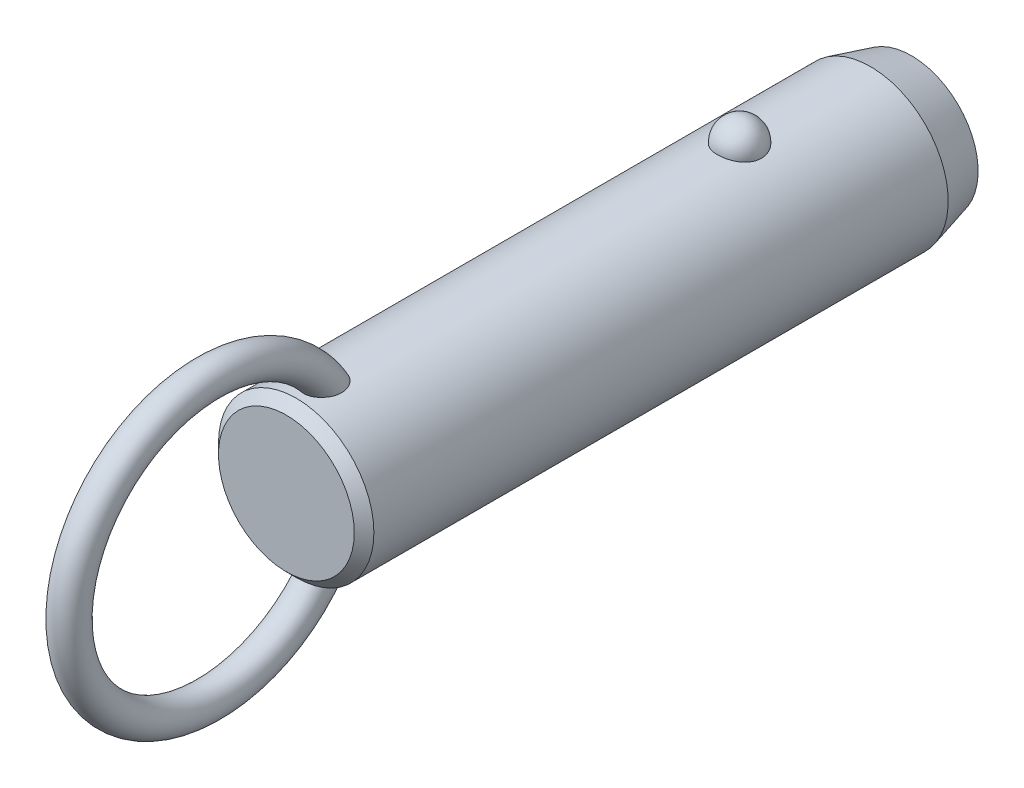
ISO-10303-21;
HEADER;
FILE_DESCRIPTION(('STEP AP214'),'2;1');
FILE_NAME('part.step','',(''),(''),'','','');
FILE_SCHEMA(('AUTOMOTIVE_DESIGN { 1 0 10303 214 1 1 1 1 }'));
ENDSEC;
DATA;
#1=APPLICATION_CONTEXT('core data for automotive mechanical design processes');
#2=APPLICATION_PROTOCOL_DEFINITION('international standard','automotive_design',2000,#1);
#3=PRODUCT_CONTEXT('',#1,'mechanical');
#4=PRODUCT('Part','Part','',(#3));
#5=PRODUCT_RELATED_PRODUCT_CATEGORY('part','',(#4));
#6=PRODUCT_DEFINITION_FORMATION('','',#4);
#7=PRODUCT_DEFINITION_CONTEXT('part definition',#1,'design');
#8=PRODUCT_DEFINITION('design','',#6,#7);
#9=PRODUCT_DEFINITION_SHAPE('','',#8);
#10=(LENGTH_UNIT() NAMED_UNIT(*) SI_UNIT(.MILLI.,.METRE.));
#11=(NAMED_UNIT(*) PLANE_ANGLE_UNIT() SI_UNIT($,.RADIAN.));
#12=(NAMED_UNIT(*) SI_UNIT($,.STERADIAN.) SOLID_ANGLE_UNIT());
#13=UNCERTAINTY_MEASURE_WITH_UNIT(LENGTH_MEASURE(1.E-05),#10,'distance_accuracy_value','');
#14=(GEOMETRIC_REPRESENTATION_CONTEXT(3) GLOBAL_UNCERTAINTY_ASSIGNED_CONTEXT((#13)) GLOBAL_UNIT_ASSIGNED_CONTEXT((#10,
#11,#12)) REPRESENTATION_CONTEXT('',''));
#15=CARTESIAN_POINT('',(0.,0.,0.));
#16=DIRECTION('',(0.,0.,1.));
#17=DIRECTION('',(1.,0.,0.));
#18=AXIS2_PLACEMENT_3D('',#15,#16,#17);
#19=CARTESIAN_POINT('',(0.,0.,43.2));
#20=DIRECTION('',(0.,0.,-1.));
#21=DIRECTION('',(-1.,0.,0.));
#22=AXIS2_PLACEMENT_3D('',#19,#20,#21);
#23=CYLINDRICAL_SURFACE('',#22,9.5);
#24=CARTESIAN_POINT('',(2.67259918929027,9.11631578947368,-2.7));
#25=CARTESIAN_POINT('',(2.6725968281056,9.11631786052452,-2.54909854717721));
#26=CARTESIAN_POINT('',(2.66030567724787,9.11994722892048,-2.39816735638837));
#27=CARTESIAN_POINT('',(2.6114347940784,9.13405924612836,-2.10058568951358));
#28=CARTESIAN_POINT('',(2.57484658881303,9.14454428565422,-1.95393672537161));
#29=CARTESIAN_POINT('',(2.47830875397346,9.17117631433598,-1.66916069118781));
#30=CARTESIAN_POINT('',(2.41836936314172,9.18732082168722,-1.53102991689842));
#31=CARTESIAN_POINT('',(2.27661331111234,9.22346780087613,-1.26705393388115));
#32=CARTESIAN_POINT('',(2.19479699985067,9.24347021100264,-1.14120852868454));
#33=CARTESIAN_POINT('',(2.01085282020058,9.28522401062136,-0.904632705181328));
#34=CARTESIAN_POINT('',(1.90862396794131,9.30698376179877,-0.793982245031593));
#35=CARTESIAN_POINT('',(1.6867437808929,9.34973971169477,-0.591607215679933));
#36=CARTESIAN_POINT('',(1.56709244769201,9.37073591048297,-0.49988264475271));
#37=CARTESIAN_POINT('',(1.31393976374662,9.40956370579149,-0.338167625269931));
#38=CARTESIAN_POINT('',(1.18048026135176,9.42740444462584,-0.268113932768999));
#39=CARTESIAN_POINT('',(0.903154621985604,9.45799906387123,-0.151390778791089));
#40=CARTESIAN_POINT('',(0.759289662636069,9.47075351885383,-0.104718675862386));
#41=CARTESIAN_POINT('',(0.468074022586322,9.48956256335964,-0.0367633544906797));
#42=CARTESIAN_POINT('',(0.320836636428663,9.49573643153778,-0.015027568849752));
#43=CARTESIAN_POINT('',(0.0246714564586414,9.50112183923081,0.00396199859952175));
#44=CARTESIAN_POINT('',(-0.124256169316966,9.50033406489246,0.00121819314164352));
#45=CARTESIAN_POINT('',(-0.417264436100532,9.4919475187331,-0.0284441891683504));
#46=CARTESIAN_POINT('',(-0.56138413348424,9.48444885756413,-0.0550074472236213));
#47=CARTESIAN_POINT('',(-0.842986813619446,9.46357853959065,-0.131064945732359));
#48=CARTESIAN_POINT('',(-0.980469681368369,9.450206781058,-0.180559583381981));
#49=CARTESIAN_POINT('',(-1.24585005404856,9.41890822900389,-0.301476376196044));
#50=CARTESIAN_POINT('',(-1.37368611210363,9.40095498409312,-0.373026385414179));
#51=CARTESIAN_POINT('',(-1.61552738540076,9.3624296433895,-0.536025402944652));
#52=CARTESIAN_POINT('',(-1.72953116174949,9.34185727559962,-0.627476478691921));
#53=CARTESIAN_POINT('',(-1.9429225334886,9.29984568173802,-0.829844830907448));
#54=CARTESIAN_POINT('',(-2.04198021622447,9.27839736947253,-0.941108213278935));
#55=CARTESIAN_POINT('',(-2.2202646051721,9.23735994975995,-1.17883414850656));
#56=CARTESIAN_POINT('',(-2.29948985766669,9.21777097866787,-1.30529781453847));
#57=CARTESIAN_POINT('',(-2.43697287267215,9.18238994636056,-1.57158566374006));
#58=CARTESIAN_POINT('',(-2.49497068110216,9.16664569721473,-1.71155057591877));
#59=CARTESIAN_POINT('',(-2.5872073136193,9.14104303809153,-1.99961197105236));
#60=CARTESIAN_POINT('',(-2.62144683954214,9.13118445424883,-2.14770821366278));
#61=CARTESIAN_POINT('',(-2.66521466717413,9.11850622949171,-2.44715424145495));
#62=CARTESIAN_POINT('',(-2.67484831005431,9.11565658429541,-2.59848735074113));
#63=CARTESIAN_POINT('',(-2.66946735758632,9.11723375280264,-2.90067317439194));
#64=CARTESIAN_POINT('',(-2.65445345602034,9.12166036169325,-3.05152590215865));
#65=CARTESIAN_POINT('',(-2.60029711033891,9.13724422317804,-3.34766110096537));
#66=CARTESIAN_POINT('',(-2.56127978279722,9.14836656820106,-3.49296833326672));
#67=CARTESIAN_POINT('',(-2.46018844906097,9.17606676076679,-3.77477535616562));
#68=CARTESIAN_POINT('',(-2.39811349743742,9.1926448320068,-3.9112747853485));
#69=CARTESIAN_POINT('',(-2.25202303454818,9.22952198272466,-4.17244273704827));
#70=CARTESIAN_POINT('',(-2.16788714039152,9.24984129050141,-4.29704106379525));
#71=CARTESIAN_POINT('',(-1.9799408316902,9.29188255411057,-4.53013066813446));
#72=CARTESIAN_POINT('',(-1.87612963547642,9.31360456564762,-4.63862130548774));
#73=CARTESIAN_POINT('',(-1.65105429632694,9.35612959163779,-4.8369029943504));
#74=CARTESIAN_POINT('',(-1.52972405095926,9.37692871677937,-4.92661991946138));
#75=CARTESIAN_POINT('',(-1.27318250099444,9.41518970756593,-5.08429106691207));
#76=CARTESIAN_POINT('',(-1.13797219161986,9.432651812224,-5.15224684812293));
#77=CARTESIAN_POINT('',(-0.859280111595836,9.46208255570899,-5.26371827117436));
#78=CARTESIAN_POINT('',(-0.715925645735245,9.47411833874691,-5.30753421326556));
#79=CARTESIAN_POINT('',(-0.423550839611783,9.4916822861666,-5.37076321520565));
#80=CARTESIAN_POINT('',(-0.274531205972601,9.49721125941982,-5.39017930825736));
#81=CARTESIAN_POINT('',(0.0218446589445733,9.50110860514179,-5.40390587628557));
#82=CARTESIAN_POINT('',(0.169177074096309,9.49961381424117,-5.39869609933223));
#83=CARTESIAN_POINT('',(0.460808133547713,9.48993906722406,-5.36441955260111));
#84=CARTESIAN_POINT('',(0.605106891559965,9.48175936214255,-5.33535367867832));
#85=CARTESIAN_POINT('',(0.886027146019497,9.4596376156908,-5.25435587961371));
#86=CARTESIAN_POINT('',(1.02267710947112,9.44571881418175,-5.20251612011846));
#87=CARTESIAN_POINT('',(1.28523827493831,9.41358993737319,-5.07741549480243));
#88=CARTESIAN_POINT('',(1.41114877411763,9.39537958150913,-5.00415322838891));
#89=CARTESIAN_POINT('',(1.65085227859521,9.3562644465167,-4.83684599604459));
#90=CARTESIAN_POINT('',(1.76442346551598,9.33532178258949,-4.74249218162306));
#91=CARTESIAN_POINT('',(1.97425672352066,9.29321198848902,-4.53620389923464));
#92=CARTESIAN_POINT('',(2.07051582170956,9.27204482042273,-4.42426641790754));
#93=CARTESIAN_POINT('',(2.24490086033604,9.23139221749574,-4.18363183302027));
#94=CARTESIAN_POINT('',(2.32267019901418,9.21194380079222,-4.05466990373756));
#95=CARTESIAN_POINT('',(2.45584092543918,9.1773419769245,-3.78517836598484));
#96=CARTESIAN_POINT('',(2.5112497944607,9.16218713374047,-3.64465264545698));
#97=CARTESIAN_POINT('',(2.59380876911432,9.13913522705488,-3.37104301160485));
#98=CARTESIAN_POINT('',(2.62330266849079,9.13064624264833,-3.23871053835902));
#99=CARTESIAN_POINT('',(2.66269870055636,9.11923566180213,-2.97092664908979));
#100=CARTESIAN_POINT('',(2.67260130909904,9.11631393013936,-2.83547530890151));
#101=CARTESIAN_POINT('',(2.67259918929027,9.11631578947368,-2.7));
#102=B_SPLINE_CURVE_WITH_KNOTS('',3,(#24,#25,#26,#27,#28,#29,#30,#31,#32,#33,#34,#35,#36,#37,
#38,#39,#40,#41,#42,#43,#44,#45,#46,#47,#48,#49,#50,#51,#52,#53,#54,#55,#56,#57,#58,#59,#60,#61,
#62,#63,#64,#65,#66,#67,#68,#69,#70,#71,#72,#73,#74,#75,#76,#77,#78,#79,#80,#81,#82,#83,#84,#85,
#86,#87,#88,#89,#90,#91,#92,#93,#94,#95,#96,#97,#98,#99,#100,#101),.UNSPECIFIED.,.T.,.F.,(4,2,2,
2,2,2,2,2,2,2,2,2,2,2,2,2,2,2,2,2,2,2,2,2,2,2,2,2,2,2,2,2,2,2,2,2,2,2,4),(0.,0.452217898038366,
0.904593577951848,1.35677112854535,1.80894144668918,2.26340676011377,2.71787203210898,
3.17099820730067,3.62407318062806,4.0687883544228,4.51345969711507,4.95160616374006,
5.38976021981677,5.83050358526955,6.27129275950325,6.72071308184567,7.17016633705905,
7.62495278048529,8.07972578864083,8.53254856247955,8.98535859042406,9.43582813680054,
9.88631615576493,10.3393155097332,10.7923328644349,11.2471065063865,11.7018475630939,
12.150795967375,12.599688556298,13.0398725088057,13.4800399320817,13.9184421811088,
14.3568730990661,14.802202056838,15.2476074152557,15.7010097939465,16.1542603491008,
16.5602594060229,16.966248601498),.UNSPECIFIED.);
#103=CARTESIAN_POINT('',(2.67259918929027,9.11631578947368,-2.7));
#104=VERTEX_POINT('',#103);
#105=EDGE_CURVE('E41',#104,#104,#102,.T.);
#106=ORIENTED_EDGE('',*,*,#105,.T.);
#107=EDGE_LOOP('',(#106));
#108=FACE_BOUND('',#107,.T.);
#109=CARTESIAN_POINT('',(0.,0.,51.5200000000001));
#110=DIRECTION('',(0.,0.,1.));
#111=DIRECTION('',(1.,0.,0.));
#112=AXIS2_PLACEMENT_3D('',#109,#110,#111);
#113=CIRCLE('',#112,9.5);
#114=CARTESIAN_POINT('',(9.5,0.,51.5200000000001));
#115=VERTEX_POINT('',#114);
#116=EDGE_CURVE('E10',#115,#115,#113,.F.);
#117=ORIENTED_EDGE('',*,*,#116,.T.);
#118=EDGE_LOOP('',(#117));
#119=FACE_BOUND('',#118,.T.);
#120=CARTESIAN_POINT('',(-0.697062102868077,-9.47439269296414,45.8678088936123));
#121=CARTESIAN_POINT('',(-0.799579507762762,-9.46685146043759,45.9074823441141));
#122=CARTESIAN_POINT('',(-0.898575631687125,-9.45788043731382,45.9559309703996));
#123=CARTESIAN_POINT('',(-1.08670047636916,-9.43811593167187,46.0688685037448));
#124=CARTESIAN_POINT('',(-1.17583204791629,-9.42732297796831,46.133352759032));
#125=CARTESIAN_POINT('',(-1.34179806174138,-9.40513672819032,46.2762099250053));
#126=CARTESIAN_POINT('',(-1.41865133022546,-9.39374438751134,46.354561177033));
#127=CARTESIAN_POINT('',(-1.5586004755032,-9.37154196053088,46.5227524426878));
#128=CARTESIAN_POINT('',(-1.62169476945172,-9.3607319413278,46.6125937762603));
#129=CARTESIAN_POINT('',(-1.73527695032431,-9.34035749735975,46.8045001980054));
#130=CARTESIAN_POINT('',(-1.7852226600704,-9.33085270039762,46.9068910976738));
#131=CARTESIAN_POINT('',(-1.86924997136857,-9.3143834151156,47.118148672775));
#132=CARTESIAN_POINT('',(-1.90332570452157,-9.30741986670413,47.2270177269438));
#133=CARTESIAN_POINT('',(-1.95893603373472,-9.29588482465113,47.4604730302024));
#134=CARTESIAN_POINT('',(-1.97872420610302,-9.29165182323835,47.5854890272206));
#135=CARTESIAN_POINT('',(-2.00062129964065,-9.28695978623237,47.8370805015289));
#136=CARTESIAN_POINT('',(-2.00272284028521,-9.28650232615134,47.963656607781));
#137=CARTESIAN_POINT('',(-1.98958876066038,-9.28932750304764,48.2368157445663));
#138=CARTESIAN_POINT('',(-1.97143366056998,-9.2932400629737,48.3832519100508));
#139=CARTESIAN_POINT('',(-1.91479925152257,-9.30507151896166,48.6720629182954));
#140=CARTESIAN_POINT('',(-1.87629122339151,-9.31299607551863,48.814431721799));
#141=CARTESIAN_POINT('',(-1.77225683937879,-9.33340232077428,49.1151725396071));
#142=CARTESIAN_POINT('',(-1.70334898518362,-9.34641636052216,49.2723691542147));
#143=CARTESIAN_POINT('',(-1.58111062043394,-9.36759153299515,49.4975171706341));
#144=CARTESIAN_POINT('',(-1.53721459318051,-9.37492619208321,49.5707968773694));
#145=CARTESIAN_POINT('',(-1.44302631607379,-9.38988566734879,49.7130740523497));
#146=CARTESIAN_POINT('',(-1.39273721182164,-9.39751033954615,49.7820736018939));
#147=CARTESIAN_POINT('',(-1.26775962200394,-9.41530678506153,49.9369832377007));
#148=CARTESIAN_POINT('',(-1.19052326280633,-9.42548108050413,50.0208712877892));
#149=CARTESIAN_POINT('',(-1.0242024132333,-9.44499825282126,50.1760086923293));
#150=CARTESIAN_POINT('',(-0.935139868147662,-9.45434261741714,50.2472808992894));
#151=CARTESIAN_POINT('',(-0.766610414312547,-9.46930670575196,50.3586955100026));
#152=CARTESIAN_POINT('',(-0.689439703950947,-9.47529223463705,50.4022354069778));
#153=CARTESIAN_POINT('',(-0.528942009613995,-9.48560294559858,50.4763133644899));
#154=CARTESIAN_POINT('',(-0.445620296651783,-9.48992953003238,50.5068624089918));
#155=CARTESIAN_POINT('',(-0.273901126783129,-9.49644161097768,50.5525792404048));
#156=CARTESIAN_POINT('',(-0.185465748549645,-9.49860811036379,50.56761059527));
#157=CARTESIAN_POINT('',(-0.00734541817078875,-9.5004135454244,50.5801494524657));
#158=CARTESIAN_POINT('',(0.0823387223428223,-9.50005405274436,50.5776678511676));
#159=CARTESIAN_POINT('',(0.247679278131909,-9.49708301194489,50.5569959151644));
#160=CARTESIAN_POINT('',(0.323620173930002,-9.49477609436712,50.5409300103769));
#161=CARTESIAN_POINT('',(0.471981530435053,-9.48855917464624,50.4971726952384));
#162=CARTESIAN_POINT('',(0.544400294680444,-9.48464840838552,50.4694757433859));
#163=CARTESIAN_POINT('',(0.708947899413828,-9.47398336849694,50.3928026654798));
#164=CARTESIAN_POINT('',(0.799149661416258,-9.46671310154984,50.3397745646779));
#165=CARTESIAN_POINT('',(0.969783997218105,-9.4507622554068,50.2199731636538));
#166=CARTESIAN_POINT('',(1.05019415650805,-9.44207854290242,50.1531692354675));
#167=CARTESIAN_POINT('',(1.23092343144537,-9.42051459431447,49.9807596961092));
#168=CARTESIAN_POINT('',(1.32652499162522,-9.40733378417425,49.8702619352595));
#169=CARTESIAN_POINT('',(1.49893121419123,-9.38140745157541,49.6355614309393));
#170=CARTESIAN_POINT('',(1.57571616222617,-9.36866239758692,49.5113445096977));
#171=CARTESIAN_POINT('',(1.71285426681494,-9.34457644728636,49.2493891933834));
#172=CARTESIAN_POINT('',(1.77266365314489,-9.33328726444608,49.1113623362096));
#173=CARTESIAN_POINT('',(1.87239208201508,-9.31379209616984,48.8280515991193));
#174=CARTESIAN_POINT('',(1.91230158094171,-9.3055875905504,48.682764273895));
#175=CARTESIAN_POINT('',(1.9760418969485,-9.29228394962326,48.3620281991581));
#176=CARTESIAN_POINT('',(1.99587438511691,-9.28797202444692,48.1857248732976));
#177=CARTESIAN_POINT('',(2.0029570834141,-9.28645519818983,47.8324146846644));
#178=CARTESIAN_POINT('',(1.99025930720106,-9.28923895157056,47.6554093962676));
#179=CARTESIAN_POINT('',(1.93735479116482,-9.30038134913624,47.3563381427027));
#180=CARTESIAN_POINT('',(1.90576827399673,-9.30697680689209,47.2326679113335));
#181=CARTESIAN_POINT('',(1.82287484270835,-9.32356855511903,46.9923297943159));
#182=CARTESIAN_POINT('',(1.77158213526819,-9.33356239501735,46.8756569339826));
#183=CARTESIAN_POINT('',(1.64885744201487,-9.35602275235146,46.6527061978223));
#184=CARTESIAN_POINT('',(1.57730995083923,-9.36850332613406,46.5464927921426));
#185=CARTESIAN_POINT('',(1.41543264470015,-9.39431873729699,46.3495530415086));
#186=CARTESIAN_POINT('',(1.32510883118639,-9.40765330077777,46.2588217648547));
#187=CARTESIAN_POINT('',(1.13846223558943,-9.43195720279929,46.1050334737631));
#188=CARTESIAN_POINT('',(1.04369890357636,-9.44302894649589,46.0400947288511));
#189=CARTESIAN_POINT('',(0.843965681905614,-9.46296805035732,45.9280388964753));
#190=CARTESIAN_POINT('',(0.739000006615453,-9.4718363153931,45.8809144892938));
#191=CARTESIAN_POINT('',(0.528175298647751,-9.48586140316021,45.8081173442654));
#192=CARTESIAN_POINT('',(0.422686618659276,-9.49119633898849,45.7814024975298));
#193=CARTESIAN_POINT('',(0.208590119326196,-9.49831365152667,45.7460137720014));
#194=CARTESIAN_POINT('',(0.0999817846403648,-9.500095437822,45.7373428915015));
#195=CARTESIAN_POINT('',(-0.12610480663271,-9.49988861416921,45.7383501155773));
#196=CARTESIAN_POINT('',(-0.243578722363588,-9.49757821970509,45.7495942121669));
#197=CARTESIAN_POINT('',(-0.474390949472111,-9.48885165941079,45.793167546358));
#198=CARTESIAN_POINT('',(-0.587729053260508,-9.48243528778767,45.8254978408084));
#199=CARTESIAN_POINT('',(-0.697062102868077,-9.47439269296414,45.8678088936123));
#200=B_SPLINE_CURVE_WITH_KNOTS('',3,(#120,#121,#122,#123,#124,#125,#126,#127,#128,#129,#130,
#131,#132,#133,#134,#135,#136,#137,#138,#139,#140,#141,#142,#143,#144,#145,#146,#147,#148,#149,
#150,#151,#152,#153,#154,#155,#156,#157,#158,#159,#160,#161,#162,#163,#164,#165,#166,#167,#168,
#169,#170,#171,#172,#173,#174,#175,#176,#177,#178,#179,#180,#181,#182,#183,#184,#185,#186,#187,
#188,#189,#190,#191,#192,#193,#194,#195,#196,#197,#198,#199),.UNSPECIFIED.,.T.,.F.,(4,2,2,2,2,2,
2,2,2,2,2,2,2,2,2,2,2,2,2,2,2,2,2,2,2,2,2,2,2,2,2,2,2,2,2,2,2,2,2,4),(0.,0.330119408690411,
0.660143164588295,0.989655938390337,1.31920659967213,1.66074728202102,2.00241415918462,
2.38088696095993,2.75951768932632,3.20065679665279,3.6424200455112,4.15620996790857,
4.41314162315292,4.66994734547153,5.01228664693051,5.35399933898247,5.61943037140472,
5.88463652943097,6.15215502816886,6.41950709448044,6.65144391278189,6.88349136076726,
7.19641200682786,7.51003602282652,7.94779711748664,8.38601491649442,8.83699707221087,
9.28819530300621,9.81778662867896,10.3465317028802,10.7284172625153,11.1100280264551,
11.4938603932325,11.8775702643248,12.2220189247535,12.5663259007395,12.8915939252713,
13.2169159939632,13.5689650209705,13.9210316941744),.UNSPECIFIED.);
#201=CARTESIAN_POINT('',(-0.697062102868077,-9.47439269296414,45.8678088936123));
#202=VERTEX_POINT('',#201);
#203=EDGE_CURVE('E60',#202,#202,#200,.T.);
#204=ORIENTED_EDGE('',*,*,#203,.T.);
#205=EDGE_LOOP('',(#204));
#206=FACE_BOUND('',#205,.T.);
#207=CARTESIAN_POINT('',(-0.697062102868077,9.47439269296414,45.8678088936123));
#208=CARTESIAN_POINT('',(-0.597792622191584,9.48169483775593,45.8293956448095));
#209=CARTESIAN_POINT('',(-0.495106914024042,9.48766580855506,45.7991682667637));
#210=CARTESIAN_POINT('',(-0.285876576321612,9.49627648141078,45.7560327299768));
#211=CARTESIAN_POINT('',(-0.179324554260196,9.49890941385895,45.7431597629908));
#212=CARTESIAN_POINT('',(0.0344157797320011,9.50053798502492,45.7351666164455));
#213=CARTESIAN_POINT('',(0.141603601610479,9.49953613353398,45.7400341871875));
#214=CARTESIAN_POINT('',(0.353563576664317,9.49401038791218,45.7673654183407));
#215=CARTESIAN_POINT('',(0.458336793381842,9.48948807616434,45.78982117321));
#216=CARTESIAN_POINT('',(0.662493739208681,9.4774236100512,45.8516719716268));
#217=CARTESIAN_POINT('',(0.761881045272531,9.46988348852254,45.8910556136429));
#218=CARTESIAN_POINT('',(0.952608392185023,9.45260382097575,45.9856342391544));
#219=CARTESIAN_POINT('',(1.04394806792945,9.44286417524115,46.0408299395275));
#220=CARTESIAN_POINT('',(1.21712767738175,9.4221176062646,46.1660662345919));
#221=CARTESIAN_POINT('',(1.29885671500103,9.41109835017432,46.2362579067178));
#222=CARTESIAN_POINT('',(1.4497897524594,9.38903310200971,46.388980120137));
#223=CARTESIAN_POINT('',(1.51899278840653,9.37798710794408,46.4715116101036));
#224=CARTESIAN_POINT('',(1.64602857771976,9.35654375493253,46.6497763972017));
#225=CARTESIAN_POINT('',(1.70333052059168,9.34618688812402,46.7458916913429));
#226=CARTESIAN_POINT('',(1.80259341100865,9.32755128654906,46.945897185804));
#227=CARTESIAN_POINT('',(1.84454942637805,9.31927322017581,47.0497898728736));
#228=CARTESIAN_POINT('',(1.91637039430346,9.30478365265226,47.2722131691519));
#229=CARTESIAN_POINT('',(1.944805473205,9.29882552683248,47.3912192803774));
#230=CARTESIAN_POINT('',(1.98449865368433,9.29043398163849,47.6321436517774));
#231=CARTESIAN_POINT('',(1.99574908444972,9.28800213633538,47.7540631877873));
#232=CARTESIAN_POINT('',(2.00275141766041,9.28649645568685,48.0169324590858));
#233=CARTESIAN_POINT('',(1.99588238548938,9.28799035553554,48.1579529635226));
#234=CARTESIAN_POINT('',(1.96270559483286,9.29505517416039,48.4376217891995));
#235=CARTESIAN_POINT('',(1.93637872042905,9.30063010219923,48.576267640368));
#236=CARTESIAN_POINT('',(1.85949176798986,9.31633564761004,48.8725616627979));
#237=CARTESIAN_POINT('',(1.80549792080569,9.3270926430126,49.0292907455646));
#238=CARTESIAN_POINT('',(1.67376869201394,9.3516306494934,49.3322840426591));
#239=CARTESIAN_POINT('',(1.59603181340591,9.36541185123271,49.4785475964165));
#240=CARTESIAN_POINT('',(1.4360277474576,9.39110706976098,49.7258138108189));
#241=CARTESIAN_POINT('',(1.35831795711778,9.40278656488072,49.829791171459));
#242=CARTESIAN_POINT('',(1.18774483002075,9.42585025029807,50.0245347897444));
#243=CARTESIAN_POINT('',(1.09490932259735,9.43723493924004,50.1153247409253));
#244=CARTESIAN_POINT('',(0.921110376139,9.45552616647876,50.2562033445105));
#245=CARTESIAN_POINT('',(0.843738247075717,9.46281058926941,50.3106563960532));
#246=CARTESIAN_POINT('',(0.681245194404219,9.47589120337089,50.406711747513));
#247=CARTESIAN_POINT('',(0.596135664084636,9.48168953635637,50.4483325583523));
#248=CARTESIAN_POINT('',(0.433779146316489,9.49038144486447,50.5100899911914));
#249=CARTESIAN_POINT('',(0.357459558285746,9.49359170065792,50.5326013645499));
#250=CARTESIAN_POINT('',(0.202074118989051,9.49816761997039,50.5645745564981));
#251=CARTESIAN_POINT('',(0.123010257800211,9.49953459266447,50.5740456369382));
#252=CARTESIAN_POINT('',(-0.0357372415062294,9.50026497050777,50.5791143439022));
#253=CARTESIAN_POINT('',(-0.115421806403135,9.49962433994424,50.5746840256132));
#254=CARTESIAN_POINT('',(-0.272823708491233,9.49640854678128,50.5522962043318));
#255=CARTESIAN_POINT('',(-0.35054013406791,9.4938325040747,50.5343325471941));
#256=CARTESIAN_POINT('',(-0.500580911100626,9.4870946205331,50.4868028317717));
#257=CARTESIAN_POINT('',(-0.572979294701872,9.48296359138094,50.4574618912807));
#258=CARTESIAN_POINT('',(-0.712864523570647,9.47347609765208,50.3890087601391));
#259=CARTESIAN_POINT('',(-0.780349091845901,9.46811906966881,50.3498920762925));
#260=CARTESIAN_POINT('',(-0.946309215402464,9.45329720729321,50.239432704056));
#261=CARTESIAN_POINT('',(-1.04090230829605,9.44321512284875,50.1623297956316));
#262=CARTESIAN_POINT('',(-1.21661929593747,9.42219227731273,49.9940971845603));
#263=CARTESIAN_POINT('',(-1.29770519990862,9.41124921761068,49.9029292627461));
#264=CARTESIAN_POINT('',(-1.4731964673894,9.38563439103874,49.6761621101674));
#265=CARTESIAN_POINT('',(-1.56208878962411,9.37102009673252,49.5362895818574));
#266=CARTESIAN_POINT('',(-1.71623987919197,9.34401559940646,49.2439503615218));
#267=CARTESIAN_POINT('',(-1.7814786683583,9.33162728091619,49.0914731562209));
#268=CARTESIAN_POINT('',(-1.88853837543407,9.31055541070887,48.7756470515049));
#269=CARTESIAN_POINT('',(-1.9299899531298,9.30193076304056,48.6121685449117));
#270=CARTESIAN_POINT('',(-1.98590726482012,9.29015757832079,48.2805268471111));
#271=CARTESIAN_POINT('',(-2.00040705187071,9.2870021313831,48.1123698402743));
#272=CARTESIAN_POINT('',(-1.99964701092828,9.28716218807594,47.8050806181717));
#273=CARTESIAN_POINT('',(-1.98908145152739,9.28945704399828,47.6659362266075));
#274=CARTESIAN_POINT('',(-1.94566294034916,9.29865169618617,47.3911539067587));
#275=CARTESIAN_POINT('',(-1.91282062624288,9.30554929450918,47.255514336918));
#276=CARTESIAN_POINT('',(-1.84582133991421,9.31898248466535,47.0578026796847));
#277=CARTESIAN_POINT('',(-1.82038084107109,9.32400364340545,46.9925830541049));
#278=CARTESIAN_POINT('',(-1.76350511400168,9.33492884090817,46.8649033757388));
#279=CARTESIAN_POINT('',(-1.73207305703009,9.3408324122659,46.8024418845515));
#280=CARTESIAN_POINT('',(-1.66324243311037,9.353333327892,46.6809407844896));
#281=CARTESIAN_POINT('',(-1.62584239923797,9.35993084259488,46.6219020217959));
#282=CARTESIAN_POINT('',(-1.545276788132,9.37356864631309,46.5079875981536));
#283=CARTESIAN_POINT('',(-1.50211241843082,9.38060884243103,46.4531110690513));
#284=CARTESIAN_POINT('',(-1.37681147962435,9.40004442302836,46.3099619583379));
#285=CARTESIAN_POINT('',(-1.28916358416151,9.41261047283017,46.2264295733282));
#286=CARTESIAN_POINT('',(-1.09996826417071,9.43658180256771,46.0772360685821));
#287=CARTESIAN_POINT('',(-0.998461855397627,9.44799034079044,46.0115238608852));
#288=CARTESIAN_POINT('',(-0.860188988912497,9.46103017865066,45.9394367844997));
#289=CARTESIAN_POINT('',(-0.828141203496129,9.46389141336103,45.9238511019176));
#290=CARTESIAN_POINT('',(-0.763210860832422,9.46934915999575,45.8944734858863));
#291=CARTESIAN_POINT('',(-0.730328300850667,9.47194567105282,45.8806815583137));
#292=CARTESIAN_POINT('',(-0.697062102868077,9.47439269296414,45.8678088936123));
#293=B_SPLINE_CURVE_WITH_KNOTS('',3,(#207,#208,#209,#210,#211,#212,#213,#214,#215,#216,#217,
#218,#219,#220,#221,#222,#223,#224,#225,#226,#227,#228,#229,#230,#231,#232,#233,#234,#235,#236,
#237,#238,#239,#240,#241,#242,#243,#244,#245,#246,#247,#248,#249,#250,#251,#252,#253,#254,#255,
#256,#257,#258,#259,#260,#261,#262,#263,#264,#265,#266,#267,#268,#269,#270,#271,#272,#273,#274,
#275,#276,#277,#278,#279,#280,#281,#282,#283,#284,#285,#286,#287,#288,#289,#290,#291,#292),
.UNSPECIFIED.,.T.,.F.,(4,2,2,2,2,2,2,2,2,2,2,2,2,2,2,2,2,2,2,2,2,2,2,2,2,2,2,2,2,2,2,2,2,2,2,2,
2,2,2,2,2,2,4),(0.,0.319942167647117,0.640532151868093,0.96090081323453,1.28112555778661,
1.60113495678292,1.92115886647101,2.24457323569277,2.56801248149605,2.90371927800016,
3.23953387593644,3.60560313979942,3.97183576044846,4.39383693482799,4.81625324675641,
5.31257045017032,5.80891895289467,6.19868344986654,6.58773876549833,6.87145417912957,
7.15475838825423,7.3926375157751,7.63034760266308,7.86853584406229,8.10683246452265,
8.3406366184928,8.57454843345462,8.93983939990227,9.30614105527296,9.80266668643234,
10.2996107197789,10.8040753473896,11.3079021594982,11.7249776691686,12.1418541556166,
12.3521485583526,12.562331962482,12.7725671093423,12.9827582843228,13.3458276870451,
13.7078449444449,13.8150604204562,13.9222762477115),.UNSPECIFIED.);
#294=CARTESIAN_POINT('',(-0.697062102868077,9.47439269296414,45.8678088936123));
#295=VERTEX_POINT('',#294);
#296=EDGE_CURVE('E67',#295,#295,#293,.T.);
#297=ORIENTED_EDGE('',*,*,#296,.T.);
#298=EDGE_LOOP('',(#297));
#299=FACE_BOUND('',#298,.T.);
#300=CARTESIAN_POINT('',(0.,0.,-18.7));
#301=DIRECTION('',(0.,0.,-1.));
#302=DIRECTION('',(-1.,0.,0.));
#303=AXIS2_PLACEMENT_3D('',#300,#301,#302);
#304=CIRCLE('',#303,9.5);
#305=CARTESIAN_POINT('',(-9.5,0.,-18.7));
#306=VERTEX_POINT('',#305);
#307=EDGE_CURVE('E57',#306,#306,#304,.F.);
#308=ORIENTED_EDGE('',*,*,#307,.T.);
#309=EDGE_LOOP('',(#308));
#310=FACE_BOUND('',#309,.T.);
#311=ADVANCED_FACE('F37',(#108,#119,#206,#299,#310),#23,.T.);
#312=CARTESIAN_POINT('',(0.,0.,-23.7));
#313=DIRECTION('',(0.,0.,-1.));
#314=DIRECTION('',(-1.,0.,0.));
#315=AXIS2_PLACEMENT_3D('',#312,#313,#314);
#316=PLANE('',#315);
#317=CARTESIAN_POINT('',(0.,0.,-23.7));
#318=DIRECTION('',(0.,0.,-1.));
#319=DIRECTION('',(-1.,0.,0.));
#320=AXIS2_PLACEMENT_3D('',#317,#318,#319);
#321=CIRCLE('',#320,8.1602540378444);
#322=CARTESIAN_POINT('',(-8.1602540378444,0.,-23.7));
#323=VERTEX_POINT('',#322);
#324=EDGE_CURVE('E66',#323,#323,#321,.T.);
#325=ORIENTED_EDGE('',*,*,#324,.T.);
#326=EDGE_LOOP('',(#325));
#327=FACE_BOUND('',#326,.T.);
#328=ADVANCED_FACE('F85',(#327),#316,.T.);
#329=CARTESIAN_POINT('',(0.,0.,-23.7));
#330=DIRECTION('',(0.,0.,1.));
#331=DIRECTION('',(1.,0.,0.));
#332=AXIS2_PLACEMENT_3D('',#329,#330,#331);
#333=CONICAL_SURFACE('',#332,8.1602540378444,0.261799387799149);
#334=ORIENTED_EDGE('',*,*,#307,.F.);
#335=EDGE_LOOP('',(#334));
#336=FACE_BOUND('',#335,.T.);
#337=ORIENTED_EDGE('',*,*,#324,.F.);
#338=EDGE_LOOP('',(#337));
#339=FACE_BOUND('',#338,.T.);
#340=ADVANCED_FACE('F83',(#336,#339),#333,.T.);
#341=CARTESIAN_POINT('',(0.,0.,52.72));
#342=DIRECTION('',(0.,0.,1.));
#343=DIRECTION('',(1.,0.,0.));
#344=AXIS2_PLACEMENT_3D('',#341,#342,#343);
#345=PLANE('',#344);
#346=CARTESIAN_POINT('',(0.,0.,52.72));
#347=DIRECTION('',(0.,0.,1.));
#348=DIRECTION('',(1.,0.,0.));
#349=AXIS2_PLACEMENT_3D('',#346,#347,#348);
#350=CIRCLE('',#349,8.30000000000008);
#351=CARTESIAN_POINT('',(8.30000000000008,0.,52.72));
#352=VERTEX_POINT('',#351);
#353=EDGE_CURVE('E50',#352,#352,#350,.T.);
#354=ORIENTED_EDGE('',*,*,#353,.T.);
#355=EDGE_LOOP('',(#354));
#356=FACE_BOUND('',#355,.T.);
#357=ADVANCED_FACE('F77',(#356),#345,.T.);
#358=CARTESIAN_POINT('',(0.,0.,62.25));
#359=DIRECTION('',(1.,0.,0.));
#360=DIRECTION('',(0.,0.,-1.));
#361=AXIS2_PLACEMENT_3D('',#358,#359,#360);
#362=TOROIDAL_SURFACE('',#361,17.05,2.);
#363=ORIENTED_EDGE('',*,*,#296,.F.);
#364=EDGE_LOOP('',(#363));
#365=FACE_BOUND('',#364,.T.);
#366=ORIENTED_EDGE('',*,*,#203,.F.);
#367=EDGE_LOOP('',(#366));
#368=FACE_BOUND('',#367,.T.);
#369=ADVANCED_FACE('F73',(#365,#368),#362,.T.);
#370=CARTESIAN_POINT('',(0.,0.,52.72));
#371=DIRECTION('',(0.,0.,-1.));
#372=DIRECTION('',(-1.,0.,0.));
#373=AXIS2_PLACEMENT_3D('',#370,#371,#372);
#374=CONICAL_SURFACE('',#373,8.30000000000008,0.785398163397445);
#375=ORIENTED_EDGE('',*,*,#116,.F.);
#376=EDGE_LOOP('',(#375));
#377=FACE_BOUND('',#376,.T.);
#378=ORIENTED_EDGE('',*,*,#353,.F.);
#379=EDGE_LOOP('',(#378));
#380=FACE_BOUND('',#379,.T.);
#381=ADVANCED_FACE('F39',(#377,#380),#374,.T.);
#382=CARTESIAN_POINT('',(0.,9.5,-2.7));
#383=DIRECTION('',(0.,1.,0.));
#384=DIRECTION('',(0.,0.,-1.));
#385=AXIS2_PLACEMENT_3D('',#382,#383,#384);
#386=SPHERICAL_SURFACE('',#385,2.7);
#387=ORIENTED_EDGE('',*,*,#105,.F.);
#388=EDGE_LOOP('',(#387));
#389=FACE_BOUND('',#388,.T.);
#390=ADVANCED_FACE('F79',(#389),#386,.T.);
#391=CLOSED_SHELL('',(#311,#328,#340,#357,#369,#381,#390));
#392=MANIFOLD_SOLID_BREP('B2',#391);
#393=ADVANCED_BREP_SHAPE_REPRESENTATION('',(#18,#392),#14);
#394=SHAPE_DEFINITION_REPRESENTATION(#9,#393);
ENDSEC;
END-ISO-10303-21;
